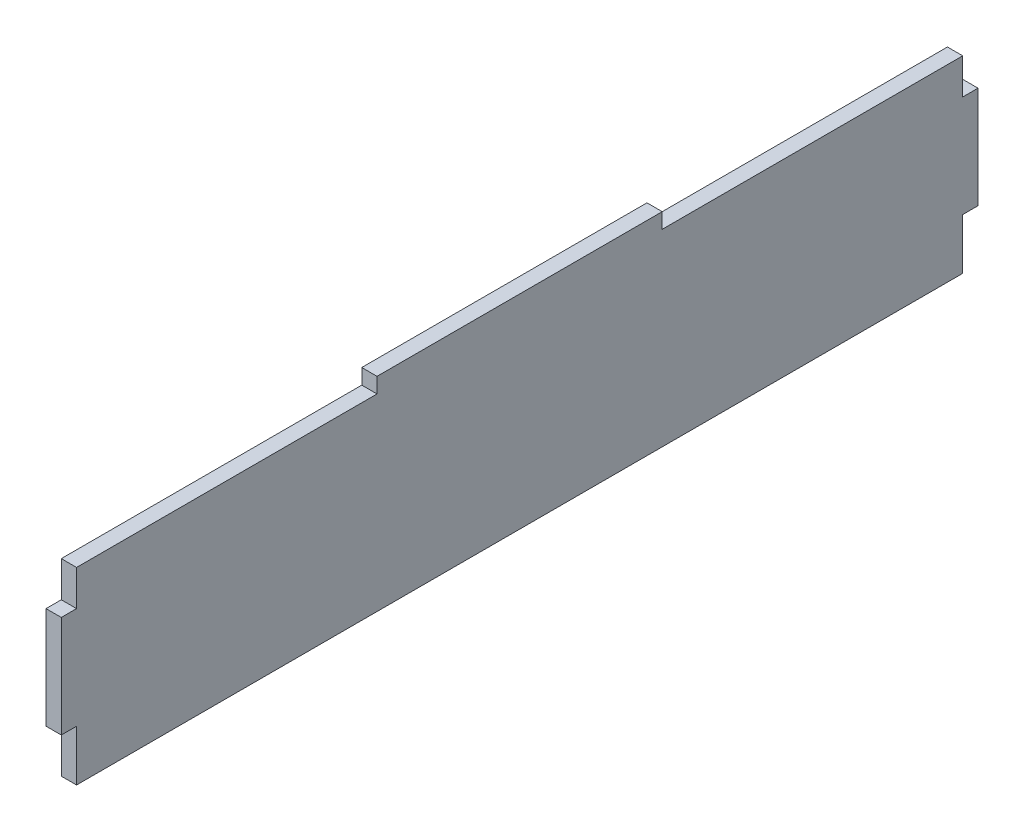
ISO-10303-21;
HEADER;
FILE_DESCRIPTION(('STEP AP214'),'2;1');
FILE_NAME('part.step','',(''),(''),'','','');
FILE_SCHEMA(('AUTOMOTIVE_DESIGN { 1 0 10303 214 1 1 1 1 }'));
ENDSEC;
DATA;
#1=APPLICATION_CONTEXT('core data for automotive mechanical design processes');
#2=APPLICATION_PROTOCOL_DEFINITION('international standard','automotive_design',2000,#1);
#3=PRODUCT_CONTEXT('',#1,'mechanical');
#4=PRODUCT('Part','Part','',(#3));
#5=PRODUCT_RELATED_PRODUCT_CATEGORY('part','',(#4));
#6=PRODUCT_DEFINITION_FORMATION('','',#4);
#7=PRODUCT_DEFINITION_CONTEXT('part definition',#1,'design');
#8=PRODUCT_DEFINITION('design','',#6,#7);
#9=PRODUCT_DEFINITION_SHAPE('','',#8);
#10=(LENGTH_UNIT() NAMED_UNIT(*) SI_UNIT(.MILLI.,.METRE.));
#11=(NAMED_UNIT(*) PLANE_ANGLE_UNIT() SI_UNIT($,.RADIAN.));
#12=(NAMED_UNIT(*) SI_UNIT($,.STERADIAN.) SOLID_ANGLE_UNIT());
#13=UNCERTAINTY_MEASURE_WITH_UNIT(LENGTH_MEASURE(1.E-05),#10,'distance_accuracy_value','');
#14=(GEOMETRIC_REPRESENTATION_CONTEXT(3) GLOBAL_UNCERTAINTY_ASSIGNED_CONTEXT((#13)) GLOBAL_UNIT_ASSIGNED_CONTEXT((#10,
#11,#12)) REPRESENTATION_CONTEXT('',''));
#15=CARTESIAN_POINT('',(0.,0.,0.));
#16=DIRECTION('',(0.,0.,1.));
#17=DIRECTION('',(1.,0.,0.));
#18=AXIS2_PLACEMENT_3D('',#15,#16,#17);
#19=CARTESIAN_POINT('',(3.,20.,-90.));
#20=DIRECTION('',(0.,0.,1.));
#21=DIRECTION('',(1.,0.,0.));
#22=AXIS2_PLACEMENT_3D('',#19,#20,#21);
#23=PLANE('',#22);
#24=DIRECTION('',(0.,1.,0.));
#25=VECTOR('',#24,1.);
#26=CARTESIAN_POINT('',(3.,20.,-90.));
#27=LINE('',#26,#25);
#28=CARTESIAN_POINT('',(3.,-10.,-90.));
#29=VERTEX_POINT('',#28);
#30=CARTESIAN_POINT('',(3.,10.,-90.));
#31=VERTEX_POINT('',#30);
#32=EDGE_CURVE('E174',#29,#31,#27,.T.);
#33=ORIENTED_EDGE('',*,*,#32,.F.);
#34=DIRECTION('',(1.,0.,0.));
#35=VECTOR('',#34,1.);
#36=CARTESIAN_POINT('',(0.,-10.,-90.));
#37=LINE('',#36,#35);
#38=CARTESIAN_POINT('',(0.,-10.,-90.));
#39=VERTEX_POINT('',#38);
#40=EDGE_CURVE('E236',#39,#29,#37,.T.);
#41=ORIENTED_EDGE('',*,*,#40,.F.);
#42=DIRECTION('',(0.,1.,0.));
#43=VECTOR('',#42,1.);
#44=CARTESIAN_POINT('',(0.,20.,-90.));
#45=LINE('',#44,#43);
#46=CARTESIAN_POINT('',(0.,10.,-90.));
#47=VERTEX_POINT('',#46);
#48=EDGE_CURVE('E176',#39,#47,#45,.T.);
#49=ORIENTED_EDGE('',*,*,#48,.T.);
#50=DIRECTION('',(1.,0.,0.));
#51=VECTOR('',#50,1.);
#52=CARTESIAN_POINT('',(0.,10.,-90.));
#53=LINE('',#52,#51);
#54=EDGE_CURVE('E201',#47,#31,#53,.T.);
#55=ORIENTED_EDGE('',*,*,#54,.T.);
#56=EDGE_LOOP('',(#33,#41,#49,#55));
#57=FACE_BOUND('',#56,.T.);
#58=ADVANCED_FACE('F35',(#57),#23,.F.);
#59=CARTESIAN_POINT('',(3.,20.,90.));
#60=DIRECTION('',(0.,-1.,0.));
#61=DIRECTION('',(0.,0.,-1.));
#62=AXIS2_PLACEMENT_3D('',#59,#60,#61);
#63=PLANE('',#62);
#64=DIRECTION('',(0.,0.,1.));
#65=VECTOR('',#64,1.);
#66=CARTESIAN_POINT('',(0.,20.,90.));
#67=LINE('',#66,#65);
#68=CARTESIAN_POINT('',(0.,20.,-28.));
#69=VERTEX_POINT('',#68);
#70=CARTESIAN_POINT('',(0.,20.,28.));
#71=VERTEX_POINT('',#70);
#72=EDGE_CURVE('E172',#69,#71,#67,.T.);
#73=ORIENTED_EDGE('',*,*,#72,.T.);
#74=DIRECTION('',(1.,0.,0.));
#75=VECTOR('',#74,1.);
#76=CARTESIAN_POINT('',(0.,20.,28.));
#77=LINE('',#76,#75);
#78=CARTESIAN_POINT('',(3.,20.,28.));
#79=VERTEX_POINT('',#78);
#80=EDGE_CURVE('E248',#71,#79,#77,.T.);
#81=ORIENTED_EDGE('',*,*,#80,.T.);
#82=DIRECTION('',(0.,0.,1.));
#83=VECTOR('',#82,1.);
#84=CARTESIAN_POINT('',(3.,20.,90.));
#85=LINE('',#84,#83);
#86=CARTESIAN_POINT('',(3.,20.,-28.));
#87=VERTEX_POINT('',#86);
#88=EDGE_CURVE('E182',#87,#79,#85,.T.);
#89=ORIENTED_EDGE('',*,*,#88,.F.);
#90=DIRECTION('',(1.,0.,0.));
#91=VECTOR('',#90,1.);
#92=CARTESIAN_POINT('',(0.,20.,-28.));
#93=LINE('',#92,#91);
#94=EDGE_CURVE('E204',#69,#87,#93,.T.);
#95=ORIENTED_EDGE('',*,*,#94,.F.);
#96=EDGE_LOOP('',(#73,#81,#89,#95));
#97=FACE_BOUND('',#96,.T.);
#98=ADVANCED_FACE('F283',(#97),#63,.F.);
#99=CARTESIAN_POINT('',(3.,20.,90.));
#100=DIRECTION('',(0.,0.,-1.));
#101=DIRECTION('',(-1.,0.,0.));
#102=AXIS2_PLACEMENT_3D('',#99,#100,#101);
#103=PLANE('',#102);
#104=DIRECTION('',(0.,-1.,0.));
#105=VECTOR('',#104,1.);
#106=CARTESIAN_POINT('',(3.,20.,90.));
#107=LINE('',#106,#105);
#108=CARTESIAN_POINT('',(3.,10.,90.));
#109=VERTEX_POINT('',#108);
#110=CARTESIAN_POINT('',(3.,-10.,90.));
#111=VERTEX_POINT('',#110);
#112=EDGE_CURVE('E43',#109,#111,#107,.T.);
#113=ORIENTED_EDGE('',*,*,#112,.F.);
#114=DIRECTION('',(1.,0.,0.));
#115=VECTOR('',#114,1.);
#116=CARTESIAN_POINT('',(0.,10.,90.));
#117=LINE('',#116,#115);
#118=CARTESIAN_POINT('',(0.,10.,90.));
#119=VERTEX_POINT('',#118);
#120=EDGE_CURVE('E152',#119,#109,#117,.T.);
#121=ORIENTED_EDGE('',*,*,#120,.F.);
#122=DIRECTION('',(0.,-1.,0.));
#123=VECTOR('',#122,1.);
#124=CARTESIAN_POINT('',(0.,20.,90.));
#125=LINE('',#124,#123);
#126=CARTESIAN_POINT('',(0.,-10.,90.));
#127=VERTEX_POINT('',#126);
#128=EDGE_CURVE('E163',#119,#127,#125,.T.);
#129=ORIENTED_EDGE('',*,*,#128,.T.);
#130=DIRECTION('',(1.,0.,0.));
#131=VECTOR('',#130,1.);
#132=CARTESIAN_POINT('',(0.,-10.,90.));
#133=LINE('',#132,#131);
#134=EDGE_CURVE('E179',#127,#111,#133,.T.);
#135=ORIENTED_EDGE('',*,*,#134,.T.);
#136=EDGE_LOOP('',(#113,#121,#129,#135));
#137=FACE_BOUND('',#136,.T.);
#138=ADVANCED_FACE('F161',(#137),#103,.F.);
#139=CARTESIAN_POINT('',(3.,-20.,90.));
#140=DIRECTION('',(0.,1.,0.));
#141=DIRECTION('',(0.,0.,1.));
#142=AXIS2_PLACEMENT_3D('',#139,#140,#141);
#143=PLANE('',#142);
#144=DIRECTION('',(0.,0.,-1.));
#145=VECTOR('',#144,1.);
#146=CARTESIAN_POINT('',(0.,-20.,90.));
#147=LINE('',#146,#145);
#148=CARTESIAN_POINT('',(0.,-20.,87.));
#149=VERTEX_POINT('',#148);
#150=CARTESIAN_POINT('',(0.,-20.,-87.));
#151=VERTEX_POINT('',#150);
#152=EDGE_CURVE('E38',#149,#151,#147,.T.);
#153=ORIENTED_EDGE('',*,*,#152,.T.);
#154=DIRECTION('',(1.,0.,0.));
#155=VECTOR('',#154,1.);
#156=CARTESIAN_POINT('',(0.,-20.,-87.));
#157=LINE('',#156,#155);
#158=CARTESIAN_POINT('',(3.,-20.,-87.));
#159=VERTEX_POINT('',#158);
#160=EDGE_CURVE('E225',#151,#159,#157,.T.);
#161=ORIENTED_EDGE('',*,*,#160,.T.);
#162=DIRECTION('',(0.,0.,-1.));
#163=VECTOR('',#162,1.);
#164=CARTESIAN_POINT('',(3.,-20.,90.));
#165=LINE('',#164,#163);
#166=CARTESIAN_POINT('',(3.,-20.,87.));
#167=VERTEX_POINT('',#166);
#168=EDGE_CURVE('E11',#167,#159,#165,.T.);
#169=ORIENTED_EDGE('',*,*,#168,.F.);
#170=DIRECTION('',(1.,0.,0.));
#171=VECTOR('',#170,1.);
#172=CARTESIAN_POINT('',(0.,-20.,87.));
#173=LINE('',#172,#171);
#174=EDGE_CURVE('E186',#149,#167,#173,.T.);
#175=ORIENTED_EDGE('',*,*,#174,.F.);
#176=EDGE_LOOP('',(#153,#161,#169,#175));
#177=FACE_BOUND('',#176,.T.);
#178=ADVANCED_FACE('F315',(#177),#143,.F.);
#179=CARTESIAN_POINT('',(3.,0.,0.));
#180=DIRECTION('',(1.,0.,0.));
#181=DIRECTION('',(0.,0.,-1.));
#182=AXIS2_PLACEMENT_3D('',#179,#180,#181);
#183=PLANE('',#182);
#184=DIRECTION('',(0.,1.,0.));
#185=VECTOR('',#184,1.);
#186=CARTESIAN_POINT('',(3.,20.,28.));
#187=LINE('',#186,#185);
#188=CARTESIAN_POINT('',(3.,17.,28.));
#189=VERTEX_POINT('',#188);
#190=EDGE_CURVE('E157',#189,#79,#187,.T.);
#191=ORIENTED_EDGE('',*,*,#190,.F.);
#192=DIRECTION('',(0.,0.,-1.));
#193=VECTOR('',#192,1.);
#194=CARTESIAN_POINT('',(3.,17.,87.));
#195=LINE('',#194,#193);
#196=CARTESIAN_POINT('',(3.,17.,87.));
#197=VERTEX_POINT('',#196);
#198=EDGE_CURVE('E260',#197,#189,#195,.T.);
#199=ORIENTED_EDGE('',*,*,#198,.F.);
#200=DIRECTION('',(0.,1.,0.));
#201=VECTOR('',#200,1.);
#202=CARTESIAN_POINT('',(3.,17.,87.));
#203=LINE('',#202,#201);
#204=CARTESIAN_POINT('',(3.,10.,87.));
#205=VERTEX_POINT('',#204);
#206=EDGE_CURVE('E263',#205,#197,#203,.T.);
#207=ORIENTED_EDGE('',*,*,#206,.F.);
#208=DIRECTION('',(0.,0.,-1.));
#209=VECTOR('',#208,1.);
#210=CARTESIAN_POINT('',(3.,10.,90.));
#211=LINE('',#210,#209);
#212=EDGE_CURVE('E266',#109,#205,#211,.T.);
#213=ORIENTED_EDGE('',*,*,#212,.F.);
#214=ORIENTED_EDGE('',*,*,#112,.T.);
#215=DIRECTION('',(0.,0.,1.));
#216=VECTOR('',#215,1.);
#217=CARTESIAN_POINT('',(3.,-10.,90.));
#218=LINE('',#217,#216);
#219=CARTESIAN_POINT('',(3.,-10.,87.));
#220=VERTEX_POINT('',#219);
#221=EDGE_CURVE('E191',#220,#111,#218,.T.);
#222=ORIENTED_EDGE('',*,*,#221,.F.);
#223=DIRECTION('',(0.,1.,0.));
#224=VECTOR('',#223,1.);
#225=CARTESIAN_POINT('',(3.,-20.,87.));
#226=LINE('',#225,#224);
#227=EDGE_CURVE('E195',#167,#220,#226,.T.);
#228=ORIENTED_EDGE('',*,*,#227,.F.);
#229=ORIENTED_EDGE('',*,*,#168,.T.);
#230=DIRECTION('',(0.,-1.,0.));
#231=VECTOR('',#230,1.);
#232=CARTESIAN_POINT('',(3.,-20.,-87.));
#233=LINE('',#232,#231);
#234=CARTESIAN_POINT('',(3.,-10.,-87.));
#235=VERTEX_POINT('',#234);
#236=EDGE_CURVE('E242',#235,#159,#233,.T.);
#237=ORIENTED_EDGE('',*,*,#236,.F.);
#238=DIRECTION('',(0.,0.,1.));
#239=VECTOR('',#238,1.);
#240=CARTESIAN_POINT('',(3.,-10.,-90.));
#241=LINE('',#240,#239);
#242=EDGE_CURVE('E245',#29,#235,#241,.T.);
#243=ORIENTED_EDGE('',*,*,#242,.F.);
#244=ORIENTED_EDGE('',*,*,#32,.T.);
#245=DIRECTION('',(0.,0.,-1.));
#246=VECTOR('',#245,1.);
#247=CARTESIAN_POINT('',(3.,10.,-90.));
#248=LINE('',#247,#246);
#249=CARTESIAN_POINT('',(3.,10.,-87.));
#250=VERTEX_POINT('',#249);
#251=EDGE_CURVE('E222',#250,#31,#248,.T.);
#252=ORIENTED_EDGE('',*,*,#251,.F.);
#253=DIRECTION('',(0.,-1.,0.));
#254=VECTOR('',#253,1.);
#255=CARTESIAN_POINT('',(3.,17.,-87.));
#256=LINE('',#255,#254);
#257=CARTESIAN_POINT('',(3.,17.,-87.));
#258=VERTEX_POINT('',#257);
#259=EDGE_CURVE('E212',#258,#250,#256,.T.);
#260=ORIENTED_EDGE('',*,*,#259,.F.);
#261=DIRECTION('',(0.,0.,-1.));
#262=VECTOR('',#261,1.);
#263=CARTESIAN_POINT('',(3.,17.,-87.));
#264=LINE('',#263,#262);
#265=CARTESIAN_POINT('',(3.,17.,-28.));
#266=VERTEX_POINT('',#265);
#267=EDGE_CURVE('E216',#266,#258,#264,.T.);
#268=ORIENTED_EDGE('',*,*,#267,.F.);
#269=DIRECTION('',(0.,-1.,0.));
#270=VECTOR('',#269,1.);
#271=CARTESIAN_POINT('',(3.,20.,-28.));
#272=LINE('',#271,#270);
#273=EDGE_CURVE('E219',#87,#266,#272,.T.);
#274=ORIENTED_EDGE('',*,*,#273,.F.);
#275=ORIENTED_EDGE('',*,*,#88,.T.);
#276=EDGE_LOOP('',(#191,#199,#207,#213,#214,#222,#228,#229,#237,#243,#244,#252,#260,#268,#274,#275));
#277=FACE_BOUND('',#276,.T.);
#278=ADVANCED_FACE('F287',(#277),#183,.T.);
#279=CARTESIAN_POINT('',(0.,0.,0.));
#280=DIRECTION('',(1.,0.,0.));
#281=DIRECTION('',(0.,0.,-1.));
#282=AXIS2_PLACEMENT_3D('',#279,#280,#281);
#283=PLANE('',#282);
#284=DIRECTION('',(0.,0.,-1.));
#285=VECTOR('',#284,1.);
#286=CARTESIAN_POINT('',(0.,17.,87.));
#287=LINE('',#286,#285);
#288=CARTESIAN_POINT('',(0.,17.,87.));
#289=VERTEX_POINT('',#288);
#290=CARTESIAN_POINT('',(0.,17.,28.));
#291=VERTEX_POINT('',#290);
#292=EDGE_CURVE('E270',#289,#291,#287,.T.);
#293=ORIENTED_EDGE('',*,*,#292,.T.);
#294=DIRECTION('',(0.,1.,0.));
#295=VECTOR('',#294,1.);
#296=CARTESIAN_POINT('',(0.,20.,28.));
#297=LINE('',#296,#295);
#298=EDGE_CURVE('E165',#291,#71,#297,.T.);
#299=ORIENTED_EDGE('',*,*,#298,.T.);
#300=ORIENTED_EDGE('',*,*,#72,.F.);
#301=DIRECTION('',(0.,-1.,0.));
#302=VECTOR('',#301,1.);
#303=CARTESIAN_POINT('',(0.,20.,-28.));
#304=LINE('',#303,#302);
#305=CARTESIAN_POINT('',(0.,17.,-28.));
#306=VERTEX_POINT('',#305);
#307=EDGE_CURVE('E231',#69,#306,#304,.T.);
#308=ORIENTED_EDGE('',*,*,#307,.T.);
#309=DIRECTION('',(0.,0.,-1.));
#310=VECTOR('',#309,1.);
#311=CARTESIAN_POINT('',(0.,17.,-87.));
#312=LINE('',#311,#310);
#313=CARTESIAN_POINT('',(0.,17.,-87.));
#314=VERTEX_POINT('',#313);
#315=EDGE_CURVE('E228',#306,#314,#312,.T.);
#316=ORIENTED_EDGE('',*,*,#315,.T.);
#317=DIRECTION('',(0.,-1.,0.));
#318=VECTOR('',#317,1.);
#319=CARTESIAN_POINT('',(0.,17.,-87.));
#320=LINE('',#319,#318);
#321=CARTESIAN_POINT('',(0.,10.,-87.));
#322=VERTEX_POINT('',#321);
#323=EDGE_CURVE('E205',#314,#322,#320,.T.);
#324=ORIENTED_EDGE('',*,*,#323,.T.);
#325=DIRECTION('',(0.,0.,-1.));
#326=VECTOR('',#325,1.);
#327=CARTESIAN_POINT('',(0.,10.,-90.));
#328=LINE('',#327,#326);
#329=EDGE_CURVE('E215',#322,#47,#328,.T.);
#330=ORIENTED_EDGE('',*,*,#329,.T.);
#331=ORIENTED_EDGE('',*,*,#48,.F.);
#332=DIRECTION('',(0.,0.,1.));
#333=VECTOR('',#332,1.);
#334=CARTESIAN_POINT('',(0.,-10.,-90.));
#335=LINE('',#334,#333);
#336=CARTESIAN_POINT('',(0.,-10.,-87.));
#337=VERTEX_POINT('',#336);
#338=EDGE_CURVE('E244',#39,#337,#335,.T.);
#339=ORIENTED_EDGE('',*,*,#338,.T.);
#340=DIRECTION('',(0.,-1.,0.));
#341=VECTOR('',#340,1.);
#342=CARTESIAN_POINT('',(0.,-20.,-87.));
#343=LINE('',#342,#341);
#344=EDGE_CURVE('E59',#337,#151,#343,.T.);
#345=ORIENTED_EDGE('',*,*,#344,.T.);
#346=ORIENTED_EDGE('',*,*,#152,.F.);
#347=DIRECTION('',(0.,1.,0.));
#348=VECTOR('',#347,1.);
#349=CARTESIAN_POINT('',(0.,-20.,87.));
#350=LINE('',#349,#348);
#351=CARTESIAN_POINT('',(0.,-10.,87.));
#352=VERTEX_POINT('',#351);
#353=EDGE_CURVE('E194',#149,#352,#350,.T.);
#354=ORIENTED_EDGE('',*,*,#353,.T.);
#355=DIRECTION('',(0.,0.,1.));
#356=VECTOR('',#355,1.);
#357=CARTESIAN_POINT('',(0.,-10.,90.));
#358=LINE('',#357,#356);
#359=EDGE_CURVE('E171',#352,#127,#358,.T.);
#360=ORIENTED_EDGE('',*,*,#359,.T.);
#361=ORIENTED_EDGE('',*,*,#128,.F.);
#362=DIRECTION('',(0.,0.,-1.));
#363=VECTOR('',#362,1.);
#364=CARTESIAN_POINT('',(0.,10.,90.));
#365=LINE('',#364,#363);
#366=CARTESIAN_POINT('',(0.,10.,87.));
#367=VERTEX_POINT('',#366);
#368=EDGE_CURVE('E148',#119,#367,#365,.T.);
#369=ORIENTED_EDGE('',*,*,#368,.T.);
#370=DIRECTION('',(0.,1.,0.));
#371=VECTOR('',#370,1.);
#372=CARTESIAN_POINT('',(0.,17.,87.));
#373=LINE('',#372,#371);
#374=EDGE_CURVE('E51',#367,#289,#373,.T.);
#375=ORIENTED_EDGE('',*,*,#374,.T.);
#376=EDGE_LOOP('',(#293,#299,#300,#308,#316,#324,#330,#331,#339,#345,#346,#354,#360,#361,#369,#375));
#377=FACE_BOUND('',#376,.T.);
#378=ADVANCED_FACE('F169',(#377),#283,.F.);
#379=CARTESIAN_POINT('',(0.,-10.,90.));
#380=DIRECTION('',(0.,1.,0.));
#381=DIRECTION('',(0.,0.,1.));
#382=AXIS2_PLACEMENT_3D('',#379,#380,#381);
#383=PLANE('',#382);
#384=ORIENTED_EDGE('',*,*,#221,.T.);
#385=ORIENTED_EDGE('',*,*,#134,.F.);
#386=ORIENTED_EDGE('',*,*,#359,.F.);
#387=DIRECTION('',(1.,0.,0.));
#388=VECTOR('',#387,1.);
#389=CARTESIAN_POINT('',(0.,-10.,87.));
#390=LINE('',#389,#388);
#391=EDGE_CURVE('E188',#352,#220,#390,.T.);
#392=ORIENTED_EDGE('',*,*,#391,.T.);
#393=EDGE_LOOP('',(#384,#385,#386,#392));
#394=FACE_BOUND('',#393,.T.);
#395=ADVANCED_FACE('F323',(#394),#383,.F.);
#396=CARTESIAN_POINT('',(0.,-20.,87.));
#397=DIRECTION('',(0.,0.,-1.));
#398=DIRECTION('',(0.,1.,0.));
#399=AXIS2_PLACEMENT_3D('',#396,#397,#398);
#400=PLANE('',#399);
#401=ORIENTED_EDGE('',*,*,#227,.T.);
#402=ORIENTED_EDGE('',*,*,#391,.F.);
#403=ORIENTED_EDGE('',*,*,#353,.F.);
#404=ORIENTED_EDGE('',*,*,#174,.T.);
#405=EDGE_LOOP('',(#401,#402,#403,#404));
#406=FACE_BOUND('',#405,.T.);
#407=ADVANCED_FACE('F320',(#406),#400,.F.);
#408=CARTESIAN_POINT('',(0.,10.,-90.));
#409=DIRECTION('',(0.,-1.,0.));
#410=DIRECTION('',(0.,0.,-1.));
#411=AXIS2_PLACEMENT_3D('',#408,#409,#410);
#412=PLANE('',#411);
#413=ORIENTED_EDGE('',*,*,#251,.T.);
#414=ORIENTED_EDGE('',*,*,#54,.F.);
#415=ORIENTED_EDGE('',*,*,#329,.F.);
#416=DIRECTION('',(1.,0.,0.));
#417=VECTOR('',#416,1.);
#418=CARTESIAN_POINT('',(0.,10.,-87.));
#419=LINE('',#418,#417);
#420=EDGE_CURVE('E198',#322,#250,#419,.T.);
#421=ORIENTED_EDGE('',*,*,#420,.T.);
#422=EDGE_LOOP('',(#413,#414,#415,#421));
#423=FACE_BOUND('',#422,.T.);
#424=ADVANCED_FACE('F302',(#423),#412,.F.);
#425=CARTESIAN_POINT('',(0.,17.,-87.));
#426=DIRECTION('',(0.,0.,1.));
#427=DIRECTION('',(0.,-1.,0.));
#428=AXIS2_PLACEMENT_3D('',#425,#426,#427);
#429=PLANE('',#428);
#430=ORIENTED_EDGE('',*,*,#259,.T.);
#431=ORIENTED_EDGE('',*,*,#420,.F.);
#432=ORIENTED_EDGE('',*,*,#323,.F.);
#433=DIRECTION('',(1.,0.,0.));
#434=VECTOR('',#433,1.);
#435=CARTESIAN_POINT('',(0.,17.,-87.));
#436=LINE('',#435,#434);
#437=EDGE_CURVE('E209',#314,#258,#436,.T.);
#438=ORIENTED_EDGE('',*,*,#437,.T.);
#439=EDGE_LOOP('',(#430,#431,#432,#438));
#440=FACE_BOUND('',#439,.T.);
#441=ADVANCED_FACE('F297',(#440),#429,.F.);
#442=CARTESIAN_POINT('',(0.,17.,-87.));
#443=DIRECTION('',(0.,-1.,0.));
#444=DIRECTION('',(0.,0.,-1.));
#445=AXIS2_PLACEMENT_3D('',#442,#443,#444);
#446=PLANE('',#445);
#447=ORIENTED_EDGE('',*,*,#267,.T.);
#448=ORIENTED_EDGE('',*,*,#437,.F.);
#449=ORIENTED_EDGE('',*,*,#315,.F.);
#450=DIRECTION('',(1.,0.,0.));
#451=VECTOR('',#450,1.);
#452=CARTESIAN_POINT('',(0.,17.,-28.));
#453=LINE('',#452,#451);
#454=EDGE_CURVE('E207',#306,#266,#453,.T.);
#455=ORIENTED_EDGE('',*,*,#454,.T.);
#456=EDGE_LOOP('',(#447,#448,#449,#455));
#457=FACE_BOUND('',#456,.T.);
#458=ADVANCED_FACE('F295',(#457),#446,.F.);
#459=CARTESIAN_POINT('',(0.,20.,-28.));
#460=DIRECTION('',(0.,0.,1.));
#461=DIRECTION('',(0.,-1.,0.));
#462=AXIS2_PLACEMENT_3D('',#459,#460,#461);
#463=PLANE('',#462);
#464=ORIENTED_EDGE('',*,*,#273,.T.);
#465=ORIENTED_EDGE('',*,*,#454,.F.);
#466=ORIENTED_EDGE('',*,*,#307,.F.);
#467=ORIENTED_EDGE('',*,*,#94,.T.);
#468=EDGE_LOOP('',(#464,#465,#466,#467));
#469=FACE_BOUND('',#468,.T.);
#470=ADVANCED_FACE('F292',(#469),#463,.F.);
#471=CARTESIAN_POINT('',(0.,-20.,-87.));
#472=DIRECTION('',(0.,0.,1.));
#473=DIRECTION('',(0.,-1.,0.));
#474=AXIS2_PLACEMENT_3D('',#471,#472,#473);
#475=PLANE('',#474);
#476=ORIENTED_EDGE('',*,*,#236,.T.);
#477=ORIENTED_EDGE('',*,*,#160,.F.);
#478=ORIENTED_EDGE('',*,*,#344,.F.);
#479=DIRECTION('',(1.,0.,0.));
#480=VECTOR('',#479,1.);
#481=CARTESIAN_POINT('',(0.,-10.,-87.));
#482=LINE('',#481,#480);
#483=EDGE_CURVE('E238',#337,#235,#482,.T.);
#484=ORIENTED_EDGE('',*,*,#483,.T.);
#485=EDGE_LOOP('',(#476,#477,#478,#484));
#486=FACE_BOUND('',#485,.T.);
#487=ADVANCED_FACE('F313',(#486),#475,.F.);
#488=CARTESIAN_POINT('',(0.,-10.,-90.));
#489=DIRECTION('',(0.,1.,0.));
#490=DIRECTION('',(0.,0.,1.));
#491=AXIS2_PLACEMENT_3D('',#488,#489,#490);
#492=PLANE('',#491);
#493=ORIENTED_EDGE('',*,*,#242,.T.);
#494=ORIENTED_EDGE('',*,*,#483,.F.);
#495=ORIENTED_EDGE('',*,*,#338,.F.);
#496=ORIENTED_EDGE('',*,*,#40,.T.);
#497=EDGE_LOOP('',(#493,#494,#495,#496));
#498=FACE_BOUND('',#497,.T.);
#499=ADVANCED_FACE('F309',(#498),#492,.F.);
#500=CARTESIAN_POINT('',(0.,20.,28.));
#501=DIRECTION('',(0.,0.,-1.));
#502=DIRECTION('',(-1.,0.,0.));
#503=AXIS2_PLACEMENT_3D('',#500,#501,#502);
#504=PLANE('',#503);
#505=ORIENTED_EDGE('',*,*,#190,.T.);
#506=ORIENTED_EDGE('',*,*,#80,.F.);
#507=ORIENTED_EDGE('',*,*,#298,.F.);
#508=DIRECTION('',(1.,0.,0.));
#509=VECTOR('',#508,1.);
#510=CARTESIAN_POINT('',(0.,17.,28.));
#511=LINE('',#510,#509);
#512=EDGE_CURVE('E255',#291,#189,#511,.T.);
#513=ORIENTED_EDGE('',*,*,#512,.T.);
#514=EDGE_LOOP('',(#505,#506,#507,#513));
#515=FACE_BOUND('',#514,.T.);
#516=ADVANCED_FACE('F280',(#515),#504,.F.);
#517=CARTESIAN_POINT('',(0.,17.,87.));
#518=DIRECTION('',(0.,-1.,0.));
#519=DIRECTION('',(0.,0.,-1.));
#520=AXIS2_PLACEMENT_3D('',#517,#518,#519);
#521=PLANE('',#520);
#522=ORIENTED_EDGE('',*,*,#198,.T.);
#523=ORIENTED_EDGE('',*,*,#512,.F.);
#524=ORIENTED_EDGE('',*,*,#292,.F.);
#525=DIRECTION('',(1.,0.,0.));
#526=VECTOR('',#525,1.);
#527=CARTESIAN_POINT('',(0.,17.,87.));
#528=LINE('',#527,#526);
#529=EDGE_CURVE('E253',#289,#197,#528,.T.);
#530=ORIENTED_EDGE('',*,*,#529,.T.);
#531=EDGE_LOOP('',(#522,#523,#524,#530));
#532=FACE_BOUND('',#531,.T.);
#533=ADVANCED_FACE('F276',(#532),#521,.F.);
#534=CARTESIAN_POINT('',(0.,17.,87.));
#535=DIRECTION('',(0.,0.,-1.));
#536=DIRECTION('',(0.,1.,0.));
#537=AXIS2_PLACEMENT_3D('',#534,#535,#536);
#538=PLANE('',#537);
#539=ORIENTED_EDGE('',*,*,#206,.T.);
#540=ORIENTED_EDGE('',*,*,#529,.F.);
#541=ORIENTED_EDGE('',*,*,#374,.F.);
#542=DIRECTION('',(1.,0.,0.));
#543=VECTOR('',#542,1.);
#544=CARTESIAN_POINT('',(0.,10.,87.));
#545=LINE('',#544,#543);
#546=EDGE_CURVE('E154',#367,#205,#545,.T.);
#547=ORIENTED_EDGE('',*,*,#546,.T.);
#548=EDGE_LOOP('',(#539,#540,#541,#547));
#549=FACE_BOUND('',#548,.T.);
#550=ADVANCED_FACE('F325',(#549),#538,.F.);
#551=CARTESIAN_POINT('',(0.,10.,90.));
#552=DIRECTION('',(0.,-1.,0.));
#553=DIRECTION('',(0.,0.,-1.));
#554=AXIS2_PLACEMENT_3D('',#551,#552,#553);
#555=PLANE('',#554);
#556=ORIENTED_EDGE('',*,*,#212,.T.);
#557=ORIENTED_EDGE('',*,*,#546,.F.);
#558=ORIENTED_EDGE('',*,*,#368,.F.);
#559=ORIENTED_EDGE('',*,*,#120,.T.);
#560=EDGE_LOOP('',(#556,#557,#558,#559));
#561=FACE_BOUND('',#560,.T.);
#562=ADVANCED_FACE('F151',(#561),#555,.F.);
#563=CLOSED_SHELL('',(#58,#98,#138,#178,#278,#378,#395,#407,#424,#441,#458,#470,#487,#499,#516,
#533,#550,#562));
#564=MANIFOLD_SOLID_BREP('B2',#563);
#565=ADVANCED_BREP_SHAPE_REPRESENTATION('',(#18,#564),#14);
#566=SHAPE_DEFINITION_REPRESENTATION(#9,#565);
ENDSEC;
END-ISO-10303-21;
